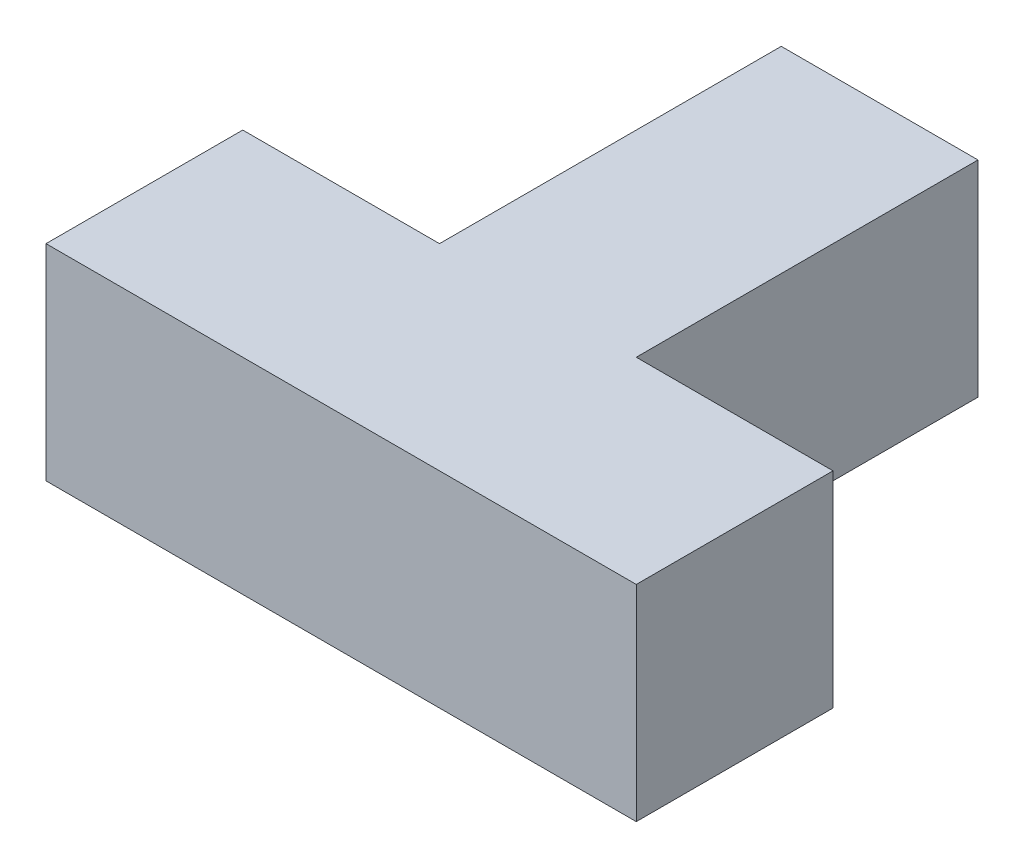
from build123d import *

# Parameters (mm, degrees)
BASE_EXTRUDE_DEPTH = 25


with BuildPart() as part:
    # Sketch1 → Base-Extrude (new body)
    with BuildSketch(Plane(origin=(0, 0, 0), x_dir=(1, 0, 0), z_dir=(0, 1, 0))):
        Polygon((0, 0), (71.826653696, 0), (71.826653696, 23.942217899), (47.884435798, 23.942217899), (47.884435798, 65.526070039), (23.942217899, 65.526070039), (23.942217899, 23.942217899), (0, 23.942217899), align=None)
    extrude(amount=BASE_EXTRUDE_DEPTH)


solid = part.part
